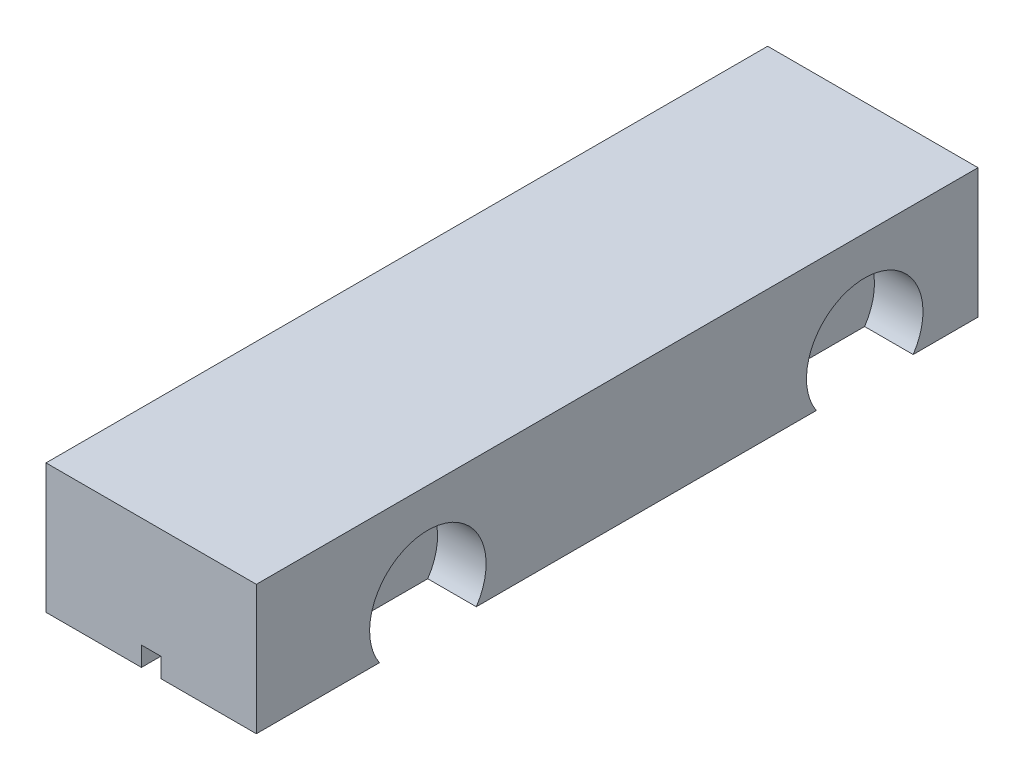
ISO-10303-21;
HEADER;
FILE_DESCRIPTION(('STEP AP214'),'2;1');
FILE_NAME('part.step','',(''),(''),'','','');
FILE_SCHEMA(('AUTOMOTIVE_DESIGN { 1 0 10303 214 1 1 1 1 }'));
ENDSEC;
DATA;
#1=APPLICATION_CONTEXT('core data for automotive mechanical design processes');
#2=APPLICATION_PROTOCOL_DEFINITION('international standard','automotive_design',2000,#1);
#3=PRODUCT_CONTEXT('',#1,'mechanical');
#4=PRODUCT('Part','Part','',(#3));
#5=PRODUCT_RELATED_PRODUCT_CATEGORY('part','',(#4));
#6=PRODUCT_DEFINITION_FORMATION('','',#4);
#7=PRODUCT_DEFINITION_CONTEXT('part definition',#1,'design');
#8=PRODUCT_DEFINITION('design','',#6,#7);
#9=PRODUCT_DEFINITION_SHAPE('','',#8);
#10=(LENGTH_UNIT() NAMED_UNIT(*) SI_UNIT(.MILLI.,.METRE.));
#11=(NAMED_UNIT(*) PLANE_ANGLE_UNIT() SI_UNIT($,.RADIAN.));
#12=(NAMED_UNIT(*) SI_UNIT($,.STERADIAN.) SOLID_ANGLE_UNIT());
#13=UNCERTAINTY_MEASURE_WITH_UNIT(LENGTH_MEASURE(1.E-05),#10,'distance_accuracy_value','');
#14=(GEOMETRIC_REPRESENTATION_CONTEXT(3) GLOBAL_UNCERTAINTY_ASSIGNED_CONTEXT((#13)) GLOBAL_UNIT_ASSIGNED_CONTEXT((#10,
#11,#12)) REPRESENTATION_CONTEXT('',''));
#15=CARTESIAN_POINT('',(0.,0.,0.));
#16=DIRECTION('',(0.,0.,1.));
#17=DIRECTION('',(1.,0.,0.));
#18=AXIS2_PLACEMENT_3D('',#15,#16,#17);
#19=CARTESIAN_POINT('',(-32.5,10.,170.));
#20=DIRECTION('',(1.,0.,0.));
#21=DIRECTION('',(0.,0.,-1.));
#22=AXIS2_PLACEMENT_3D('',#19,#20,#21);
#23=CYLINDRICAL_SURFACE('',#22,1.52500000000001);
#24=CARTESIAN_POINT('',(17.5,10.,170.));
#25=DIRECTION('',(1.,0.,0.));
#26=DIRECTION('',(0.,0.,-1.));
#27=AXIS2_PLACEMENT_3D('',#24,#25,#26);
#28=CIRCLE('',#27,1.52500000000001);
#29=CARTESIAN_POINT('',(17.5,10.,168.475));
#30=VERTEX_POINT('',#29);
#31=EDGE_CURVE('E192',#30,#30,#28,.F.);
#32=ORIENTED_EDGE('',*,*,#31,.F.);
#33=EDGE_LOOP('',(#32));
#34=FACE_BOUND('',#33,.T.);
#35=CARTESIAN_POINT('',(-17.5,10.,170.));
#36=DIRECTION('',(-1.,0.,0.));
#37=DIRECTION('',(0.,0.,1.));
#38=AXIS2_PLACEMENT_3D('',#35,#36,#37);
#39=CIRCLE('',#38,1.52500000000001);
#40=CARTESIAN_POINT('',(-17.5,10.,171.525));
#41=VERTEX_POINT('',#40);
#42=EDGE_CURVE('E149',#41,#41,#39,.F.);
#43=ORIENTED_EDGE('',*,*,#42,.F.);
#44=EDGE_LOOP('',(#43));
#45=FACE_BOUND('',#44,.T.);
#46=ADVANCED_FACE('F32',(#34,#45),#23,.F.);
#47=CARTESIAN_POINT('',(-32.5,10.,35.));
#48=DIRECTION('',(1.,0.,0.));
#49=DIRECTION('',(0.,0.,-1.));
#50=AXIS2_PLACEMENT_3D('',#47,#48,#49);
#51=CYLINDRICAL_SURFACE('',#50,1.525);
#52=CARTESIAN_POINT('',(17.5,10.,35.));
#53=DIRECTION('',(1.,0.,0.));
#54=DIRECTION('',(0.,0.,-1.));
#55=AXIS2_PLACEMENT_3D('',#52,#53,#54);
#56=CIRCLE('',#55,1.525);
#57=CARTESIAN_POINT('',(17.5,10.,33.475));
#58=VERTEX_POINT('',#57);
#59=EDGE_CURVE('E178',#58,#58,#56,.F.);
#60=ORIENTED_EDGE('',*,*,#59,.F.);
#61=EDGE_LOOP('',(#60));
#62=FACE_BOUND('',#61,.T.);
#63=CARTESIAN_POINT('',(-17.5,10.,35.));
#64=DIRECTION('',(-1.,0.,0.));
#65=DIRECTION('',(0.,0.,1.));
#66=AXIS2_PLACEMENT_3D('',#63,#64,#65);
#67=CIRCLE('',#66,1.525);
#68=CARTESIAN_POINT('',(-17.5,10.,36.525));
#69=VERTEX_POINT('',#68);
#70=EDGE_CURVE('E171',#69,#69,#67,.F.);
#71=ORIENTED_EDGE('',*,*,#70,.F.);
#72=EDGE_LOOP('',(#71));
#73=FACE_BOUND('',#72,.T.);
#74=ADVANCED_FACE('F334',(#62,#73),#51,.F.);
#75=CARTESIAN_POINT('',(-32.5,0.,223.));
#76=DIRECTION('',(0.,1.,0.));
#77=DIRECTION('',(0.,0.,1.));
#78=AXIS2_PLACEMENT_3D('',#75,#76,#77);
#79=PLANE('',#78);
#80=DIRECTION('',(0.,0.,1.));
#81=VECTOR('',#80,1.);
#82=CARTESIAN_POINT('',(-17.5,0.,223.));
#83=LINE('',#82,#81);
#84=CARTESIAN_POINT('',(-17.5,0.,155.033370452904));
#85=VERTEX_POINT('',#84);
#86=CARTESIAN_POINT('',(-17.5,0.,184.966629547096));
#87=VERTEX_POINT('',#86);
#88=EDGE_CURVE('E11',#85,#87,#83,.T.);
#89=ORIENTED_EDGE('',*,*,#88,.F.);
#90=DIRECTION('',(-1.,0.,0.));
#91=VECTOR('',#90,1.);
#92=CARTESIAN_POINT('',(-17.5,0.,155.033370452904));
#93=LINE('',#92,#91);
#94=CARTESIAN_POINT('',(-32.5,0.,155.033370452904));
#95=VERTEX_POINT('',#94);
#96=EDGE_CURVE('E144',#85,#95,#93,.T.);
#97=ORIENTED_EDGE('',*,*,#96,.T.);
#98=DIRECTION('',(0.,0.,-1.));
#99=VECTOR('',#98,1.);
#100=CARTESIAN_POINT('',(-32.5,0.,223.));
#101=LINE('',#100,#99);
#102=CARTESIAN_POINT('',(-32.5,0.,49.9666295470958));
#103=VERTEX_POINT('',#102);
#104=EDGE_CURVE('E55',#95,#103,#101,.T.);
#105=ORIENTED_EDGE('',*,*,#104,.T.);
#106=DIRECTION('',(-1.,0.,0.));
#107=VECTOR('',#106,1.);
#108=CARTESIAN_POINT('',(-17.5,0.,49.9666295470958));
#109=LINE('',#108,#107);
#110=CARTESIAN_POINT('',(-17.5,0.,49.9666295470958));
#111=VERTEX_POINT('',#110);
#112=EDGE_CURVE('E166',#103,#111,#109,.F.);
#113=ORIENTED_EDGE('',*,*,#112,.T.);
#114=DIRECTION('',(0.,0.,1.));
#115=VECTOR('',#114,1.);
#116=CARTESIAN_POINT('',(-17.5,0.,223.));
#117=LINE('',#116,#115);
#118=CARTESIAN_POINT('',(-17.5,0.,20.0333704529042));
#119=VERTEX_POINT('',#118);
#120=EDGE_CURVE('E270',#119,#111,#117,.T.);
#121=ORIENTED_EDGE('',*,*,#120,.F.);
#122=DIRECTION('',(-1.,0.,0.));
#123=VECTOR('',#122,1.);
#124=CARTESIAN_POINT('',(-17.5,0.,20.0333704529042));
#125=LINE('',#124,#123);
#126=CARTESIAN_POINT('',(-32.5,0.,20.0333704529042));
#127=VERTEX_POINT('',#126);
#128=EDGE_CURVE('E168',#119,#127,#125,.T.);
#129=ORIENTED_EDGE('',*,*,#128,.T.);
#130=CARTESIAN_POINT('',(-32.5,0.,0.));
#131=VERTEX_POINT('',#130);
#132=EDGE_CURVE('E260',#127,#131,#101,.T.);
#133=ORIENTED_EDGE('',*,*,#132,.T.);
#134=DIRECTION('',(1.,0.,0.));
#135=VECTOR('',#134,1.);
#136=CARTESIAN_POINT('',(-32.5,0.,0.));
#137=LINE('',#136,#135);
#138=CARTESIAN_POINT('',(-3.,0.,0.));
#139=VERTEX_POINT('',#138);
#140=EDGE_CURVE('E245',#131,#139,#137,.T.);
#141=ORIENTED_EDGE('',*,*,#140,.T.);
#142=DIRECTION('',(0.,0.,1.));
#143=VECTOR('',#142,1.);
#144=CARTESIAN_POINT('',(-3.,0.,0.));
#145=LINE('',#144,#143);
#146=CARTESIAN_POINT('',(-3.,0.,223.));
#147=VERTEX_POINT('',#146);
#148=EDGE_CURVE('E213',#139,#147,#145,.T.);
#149=ORIENTED_EDGE('',*,*,#148,.T.);
#150=DIRECTION('',(1.,0.,0.));
#151=VECTOR('',#150,1.);
#152=CARTESIAN_POINT('',(-32.5,0.,223.));
#153=LINE('',#152,#151);
#154=CARTESIAN_POINT('',(-32.5,0.,223.));
#155=VERTEX_POINT('',#154);
#156=EDGE_CURVE('E234',#155,#147,#153,.T.);
#157=ORIENTED_EDGE('',*,*,#156,.F.);
#158=CARTESIAN_POINT('',(-32.5,0.,184.966629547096));
#159=VERTEX_POINT('',#158);
#160=EDGE_CURVE('E158',#155,#159,#101,.T.);
#161=ORIENTED_EDGE('',*,*,#160,.T.);
#162=DIRECTION('',(-1.,0.,0.));
#163=VECTOR('',#162,1.);
#164=CARTESIAN_POINT('',(-17.5,0.,184.966629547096));
#165=LINE('',#164,#163);
#166=EDGE_CURVE('E47',#159,#87,#165,.F.);
#167=ORIENTED_EDGE('',*,*,#166,.T.);
#168=EDGE_LOOP('',(#89,#97,#105,#113,#121,#129,#133,#141,#149,#157,#161,#167));
#169=FACE_BOUND('',#168,.T.);
#170=ADVANCED_FACE('F155',(#169),#79,.F.);
#171=CARTESIAN_POINT('',(-32.5,0.,223.));
#172=DIRECTION('',(1.,0.,0.));
#173=DIRECTION('',(0.,0.,-1.));
#174=AXIS2_PLACEMENT_3D('',#171,#172,#173);
#175=PLANE('',#174);
#176=ORIENTED_EDGE('',*,*,#104,.F.);
#177=CARTESIAN_POINT('',(-32.5,10.,170.));
#178=DIRECTION('',(1.,0.,0.));
#179=DIRECTION('',(0.,0.,-1.));
#180=AXIS2_PLACEMENT_3D('',#177,#178,#179);
#181=CIRCLE('',#180,18.);
#182=EDGE_CURVE('E40',#95,#159,#181,.T.);
#183=ORIENTED_EDGE('',*,*,#182,.T.);
#184=ORIENTED_EDGE('',*,*,#160,.F.);
#185=DIRECTION('',(0.,-1.,0.));
#186=VECTOR('',#185,1.);
#187=CARTESIAN_POINT('',(-32.5,0.,223.));
#188=LINE('',#187,#186);
#189=CARTESIAN_POINT('',(-32.5,40.,223.));
#190=VERTEX_POINT('',#189);
#191=EDGE_CURVE('E229',#190,#155,#188,.T.);
#192=ORIENTED_EDGE('',*,*,#191,.F.);
#193=DIRECTION('',(0.,0.,-1.));
#194=VECTOR('',#193,1.);
#195=CARTESIAN_POINT('',(-32.5,40.,223.));
#196=LINE('',#195,#194);
#197=CARTESIAN_POINT('',(-32.5,40.,0.));
#198=VERTEX_POINT('',#197);
#199=EDGE_CURVE('E241',#190,#198,#196,.T.);
#200=ORIENTED_EDGE('',*,*,#199,.T.);
#201=DIRECTION('',(0.,-1.,0.));
#202=VECTOR('',#201,1.);
#203=CARTESIAN_POINT('',(-32.5,0.,0.));
#204=LINE('',#203,#202);
#205=EDGE_CURVE('E222',#198,#131,#204,.T.);
#206=ORIENTED_EDGE('',*,*,#205,.T.);
#207=ORIENTED_EDGE('',*,*,#132,.F.);
#208=CARTESIAN_POINT('',(-32.5,10.,35.));
#209=DIRECTION('',(1.,0.,0.));
#210=DIRECTION('',(0.,0.,-1.));
#211=AXIS2_PLACEMENT_3D('',#208,#209,#210);
#212=CIRCLE('',#211,18.);
#213=EDGE_CURVE('E263',#127,#103,#212,.T.);
#214=ORIENTED_EDGE('',*,*,#213,.T.);
#215=EDGE_LOOP('',(#176,#183,#184,#192,#200,#206,#207,#214));
#216=FACE_BOUND('',#215,.T.);
#217=ADVANCED_FACE('F34',(#216),#175,.F.);
#218=DIRECTION('',(0.,0.,-1.));
#219=VECTOR('',#218,1.);
#220=CARTESIAN_POINT('',(17.5,0.,223.));
#221=LINE('',#220,#219);
#222=CARTESIAN_POINT('',(17.5,0.,49.9666295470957));
#223=VERTEX_POINT('',#222);
#224=CARTESIAN_POINT('',(17.5,0.,20.0333704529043));
#225=VERTEX_POINT('',#224);
#226=EDGE_CURVE('E180',#223,#225,#221,.T.);
#227=ORIENTED_EDGE('',*,*,#226,.F.);
#228=DIRECTION('',(1.,0.,0.));
#229=VECTOR('',#228,1.);
#230=CARTESIAN_POINT('',(17.5,0.,49.9666295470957));
#231=LINE('',#230,#229);
#232=CARTESIAN_POINT('',(32.5,0.,49.9666295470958));
#233=VERTEX_POINT('',#232);
#234=EDGE_CURVE('E185',#223,#233,#231,.T.);
#235=ORIENTED_EDGE('',*,*,#234,.T.);
#236=DIRECTION('',(0.,0.,-1.));
#237=VECTOR('',#236,1.);
#238=CARTESIAN_POINT('',(32.5,0.,223.));
#239=LINE('',#238,#237);
#240=CARTESIAN_POINT('',(32.5,0.,155.033370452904));
#241=VERTEX_POINT('',#240);
#242=EDGE_CURVE('E261',#241,#233,#239,.T.);
#243=ORIENTED_EDGE('',*,*,#242,.F.);
#244=DIRECTION('',(1.,0.,0.));
#245=VECTOR('',#244,1.);
#246=CARTESIAN_POINT('',(17.5,0.,155.033370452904));
#247=LINE('',#246,#245);
#248=CARTESIAN_POINT('',(17.5,0.,155.033370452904));
#249=VERTEX_POINT('',#248);
#250=EDGE_CURVE('E196',#241,#249,#247,.F.);
#251=ORIENTED_EDGE('',*,*,#250,.T.);
#252=DIRECTION('',(0.,0.,-1.));
#253=VECTOR('',#252,1.);
#254=CARTESIAN_POINT('',(17.5,0.,223.));
#255=LINE('',#254,#253);
#256=CARTESIAN_POINT('',(17.5,0.,184.966629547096));
#257=VERTEX_POINT('',#256);
#258=EDGE_CURVE('E194',#257,#249,#255,.T.);
#259=ORIENTED_EDGE('',*,*,#258,.F.);
#260=DIRECTION('',(1.,0.,0.));
#261=VECTOR('',#260,1.);
#262=CARTESIAN_POINT('',(17.5,0.,184.966629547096));
#263=LINE('',#262,#261);
#264=CARTESIAN_POINT('',(32.5,0.,184.966629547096));
#265=VERTEX_POINT('',#264);
#266=EDGE_CURVE('E199',#257,#265,#263,.T.);
#267=ORIENTED_EDGE('',*,*,#266,.T.);
#268=CARTESIAN_POINT('',(32.5,0.,223.));
#269=VERTEX_POINT('',#268);
#270=EDGE_CURVE('E257',#269,#265,#239,.T.);
#271=ORIENTED_EDGE('',*,*,#270,.F.);
#272=CARTESIAN_POINT('',(3.,0.,223.));
#273=VERTEX_POINT('',#272);
#274=EDGE_CURVE('E232',#273,#269,#153,.T.);
#275=ORIENTED_EDGE('',*,*,#274,.F.);
#276=DIRECTION('',(0.,0.,1.));
#277=VECTOR('',#276,1.);
#278=CARTESIAN_POINT('',(3.,0.,0.));
#279=LINE('',#278,#277);
#280=CARTESIAN_POINT('',(3.,0.,0.));
#281=VERTEX_POINT('',#280);
#282=EDGE_CURVE('E225',#281,#273,#279,.T.);
#283=ORIENTED_EDGE('',*,*,#282,.F.);
#284=CARTESIAN_POINT('',(32.5,0.,0.));
#285=VERTEX_POINT('',#284);
#286=EDGE_CURVE('E244',#281,#285,#137,.T.);
#287=ORIENTED_EDGE('',*,*,#286,.T.);
#288=CARTESIAN_POINT('',(32.5,0.,20.0333704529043));
#289=VERTEX_POINT('',#288);
#290=EDGE_CURVE('E256',#289,#285,#239,.T.);
#291=ORIENTED_EDGE('',*,*,#290,.F.);
#292=DIRECTION('',(1.,0.,0.));
#293=VECTOR('',#292,1.);
#294=CARTESIAN_POINT('',(17.5,0.,20.0333704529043));
#295=LINE('',#294,#293);
#296=EDGE_CURVE('E182',#289,#225,#295,.F.);
#297=ORIENTED_EDGE('',*,*,#296,.T.);
#298=EDGE_LOOP('',(#227,#235,#243,#251,#259,#267,#271,#275,#283,#287,#291,#297));
#299=FACE_BOUND('',#298,.T.);
#300=ADVANCED_FACE('F298',(#299),#79,.F.);
#301=CARTESIAN_POINT('',(32.5,0.,223.));
#302=DIRECTION('',(-1.,0.,0.));
#303=DIRECTION('',(0.,0.,1.));
#304=AXIS2_PLACEMENT_3D('',#301,#302,#303);
#305=PLANE('',#304);
#306=ORIENTED_EDGE('',*,*,#242,.T.);
#307=CARTESIAN_POINT('',(32.5,10.,35.));
#308=DIRECTION('',(1.,0.,0.));
#309=DIRECTION('',(0.,0.,-1.));
#310=AXIS2_PLACEMENT_3D('',#307,#308,#309);
#311=CIRCLE('',#310,18.);
#312=EDGE_CURVE('E174',#289,#233,#311,.T.);
#313=ORIENTED_EDGE('',*,*,#312,.F.);
#314=ORIENTED_EDGE('',*,*,#290,.T.);
#315=DIRECTION('',(0.,1.,0.));
#316=VECTOR('',#315,1.);
#317=CARTESIAN_POINT('',(32.5,0.,0.));
#318=LINE('',#317,#316);
#319=CARTESIAN_POINT('',(32.5,40.,0.));
#320=VERTEX_POINT('',#319);
#321=EDGE_CURVE('E248',#285,#320,#318,.T.);
#322=ORIENTED_EDGE('',*,*,#321,.T.);
#323=DIRECTION('',(0.,0.,-1.));
#324=VECTOR('',#323,1.);
#325=CARTESIAN_POINT('',(32.5,40.,223.));
#326=LINE('',#325,#324);
#327=CARTESIAN_POINT('',(32.5,40.,223.));
#328=VERTEX_POINT('',#327);
#329=EDGE_CURVE('E253',#328,#320,#326,.T.);
#330=ORIENTED_EDGE('',*,*,#329,.F.);
#331=DIRECTION('',(0.,1.,0.));
#332=VECTOR('',#331,1.);
#333=CARTESIAN_POINT('',(32.5,0.,223.));
#334=LINE('',#333,#332);
#335=EDGE_CURVE('E237',#269,#328,#334,.T.);
#336=ORIENTED_EDGE('',*,*,#335,.F.);
#337=ORIENTED_EDGE('',*,*,#270,.T.);
#338=CARTESIAN_POINT('',(32.5,10.,170.));
#339=DIRECTION('',(1.,0.,0.));
#340=DIRECTION('',(0.,0.,-1.));
#341=AXIS2_PLACEMENT_3D('',#338,#339,#340);
#342=CIRCLE('',#341,18.);
#343=EDGE_CURVE('E188',#241,#265,#342,.T.);
#344=ORIENTED_EDGE('',*,*,#343,.F.);
#345=EDGE_LOOP('',(#306,#313,#314,#322,#330,#336,#337,#344));
#346=FACE_BOUND('',#345,.T.);
#347=ADVANCED_FACE('F291',(#346),#305,.F.);
#348=CARTESIAN_POINT('',(-32.5,40.,223.));
#349=DIRECTION('',(0.,-1.,0.));
#350=DIRECTION('',(0.,0.,-1.));
#351=AXIS2_PLACEMENT_3D('',#348,#349,#350);
#352=PLANE('',#351);
#353=DIRECTION('',(-1.,0.,0.));
#354=VECTOR('',#353,1.);
#355=CARTESIAN_POINT('',(-32.5,40.,0.));
#356=LINE('',#355,#354);
#357=EDGE_CURVE('E233',#320,#198,#356,.T.);
#358=ORIENTED_EDGE('',*,*,#357,.T.);
#359=ORIENTED_EDGE('',*,*,#199,.F.);
#360=DIRECTION('',(-1.,0.,0.));
#361=VECTOR('',#360,1.);
#362=CARTESIAN_POINT('',(-32.5,40.,223.));
#363=LINE('',#362,#361);
#364=EDGE_CURVE('E239',#328,#190,#363,.T.);
#365=ORIENTED_EDGE('',*,*,#364,.F.);
#366=ORIENTED_EDGE('',*,*,#329,.T.);
#367=EDGE_LOOP('',(#358,#359,#365,#366));
#368=FACE_BOUND('',#367,.T.);
#369=ADVANCED_FACE('F284',(#368),#352,.F.);
#370=CARTESIAN_POINT('',(-32.5,40.,223.));
#371=DIRECTION('',(0.,0.,-1.));
#372=DIRECTION('',(-1.,0.,0.));
#373=AXIS2_PLACEMENT_3D('',#370,#371,#372);
#374=PLANE('',#373);
#375=ORIENTED_EDGE('',*,*,#156,.T.);
#376=DIRECTION('',(0.,-1.,0.));
#377=VECTOR('',#376,1.);
#378=CARTESIAN_POINT('',(-3.,0.,223.));
#379=LINE('',#378,#377);
#380=CARTESIAN_POINT('',(-3.,6.,223.));
#381=VERTEX_POINT('',#380);
#382=EDGE_CURVE('E202',#381,#147,#379,.T.);
#383=ORIENTED_EDGE('',*,*,#382,.F.);
#384=DIRECTION('',(-1.,0.,0.));
#385=VECTOR('',#384,1.);
#386=CARTESIAN_POINT('',(-3.,6.,223.));
#387=LINE('',#386,#385);
#388=CARTESIAN_POINT('',(3.,6.,223.));
#389=VERTEX_POINT('',#388);
#390=EDGE_CURVE('E207',#389,#381,#387,.T.);
#391=ORIENTED_EDGE('',*,*,#390,.F.);
#392=DIRECTION('',(0.,1.,0.));
#393=VECTOR('',#392,1.);
#394=CARTESIAN_POINT('',(3.,0.,223.));
#395=LINE('',#394,#393);
#396=EDGE_CURVE('E215',#273,#389,#395,.T.);
#397=ORIENTED_EDGE('',*,*,#396,.F.);
#398=ORIENTED_EDGE('',*,*,#274,.T.);
#399=ORIENTED_EDGE('',*,*,#335,.T.);
#400=ORIENTED_EDGE('',*,*,#364,.T.);
#401=ORIENTED_EDGE('',*,*,#191,.T.);
#402=EDGE_LOOP('',(#375,#383,#391,#397,#398,#399,#400,#401));
#403=FACE_BOUND('',#402,.T.);
#404=ADVANCED_FACE('F307',(#403),#374,.F.);
#405=CARTESIAN_POINT('',(-32.5,40.,0.));
#406=DIRECTION('',(0.,0.,-1.));
#407=DIRECTION('',(-1.,0.,0.));
#408=AXIS2_PLACEMENT_3D('',#405,#406,#407);
#409=PLANE('',#408);
#410=DIRECTION('',(0.,-1.,0.));
#411=VECTOR('',#410,1.);
#412=CARTESIAN_POINT('',(-3.,0.,0.));
#413=LINE('',#412,#411);
#414=CARTESIAN_POINT('',(-3.,6.,0.));
#415=VERTEX_POINT('',#414);
#416=EDGE_CURVE('E203',#415,#139,#413,.T.);
#417=ORIENTED_EDGE('',*,*,#416,.T.);
#418=ORIENTED_EDGE('',*,*,#140,.F.);
#419=ORIENTED_EDGE('',*,*,#205,.F.);
#420=ORIENTED_EDGE('',*,*,#357,.F.);
#421=ORIENTED_EDGE('',*,*,#321,.F.);
#422=ORIENTED_EDGE('',*,*,#286,.F.);
#423=DIRECTION('',(0.,1.,0.));
#424=VECTOR('',#423,1.);
#425=CARTESIAN_POINT('',(3.,0.,0.));
#426=LINE('',#425,#424);
#427=CARTESIAN_POINT('',(3.00000000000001,6.,0.));
#428=VERTEX_POINT('',#427);
#429=EDGE_CURVE('E206',#281,#428,#426,.T.);
#430=ORIENTED_EDGE('',*,*,#429,.T.);
#431=DIRECTION('',(-1.,0.,0.));
#432=VECTOR('',#431,1.);
#433=CARTESIAN_POINT('',(-3.,6.,0.));
#434=LINE('',#433,#432);
#435=EDGE_CURVE('E210',#428,#415,#434,.T.);
#436=ORIENTED_EDGE('',*,*,#435,.T.);
#437=EDGE_LOOP('',(#417,#418,#419,#420,#421,#422,#430,#436));
#438=FACE_BOUND('',#437,.T.);
#439=ADVANCED_FACE('F278',(#438),#409,.T.);
#440=CARTESIAN_POINT('',(-3.,0.,0.));
#441=DIRECTION('',(-1.,0.,0.));
#442=DIRECTION('',(0.,0.,1.));
#443=AXIS2_PLACEMENT_3D('',#440,#441,#442);
#444=PLANE('',#443);
#445=ORIENTED_EDGE('',*,*,#382,.T.);
#446=ORIENTED_EDGE('',*,*,#148,.F.);
#447=ORIENTED_EDGE('',*,*,#416,.F.);
#448=DIRECTION('',(0.,0.,1.));
#449=VECTOR('',#448,1.);
#450=CARTESIAN_POINT('',(-3.,6.,0.));
#451=LINE('',#450,#449);
#452=EDGE_CURVE('E220',#415,#381,#451,.T.);
#453=ORIENTED_EDGE('',*,*,#452,.T.);
#454=EDGE_LOOP('',(#445,#446,#447,#453));
#455=FACE_BOUND('',#454,.T.);
#456=ADVANCED_FACE('F312',(#455),#444,.F.);
#457=CARTESIAN_POINT('',(-3.,6.,0.));
#458=DIRECTION('',(0.,1.,0.));
#459=DIRECTION('',(0.,0.,1.));
#460=AXIS2_PLACEMENT_3D('',#457,#458,#459);
#461=PLANE('',#460);
#462=ORIENTED_EDGE('',*,*,#390,.T.);
#463=ORIENTED_EDGE('',*,*,#452,.F.);
#464=ORIENTED_EDGE('',*,*,#435,.F.);
#465=DIRECTION('',(0.,0.,1.));
#466=VECTOR('',#465,1.);
#467=CARTESIAN_POINT('',(3.,6.,0.));
#468=LINE('',#467,#466);
#469=EDGE_CURVE('E223',#428,#389,#468,.T.);
#470=ORIENTED_EDGE('',*,*,#469,.T.);
#471=EDGE_LOOP('',(#462,#463,#464,#470));
#472=FACE_BOUND('',#471,.T.);
#473=ADVANCED_FACE('F310',(#472),#461,.F.);
#474=CARTESIAN_POINT('',(3.,0.,0.));
#475=DIRECTION('',(1.,0.,0.));
#476=DIRECTION('',(0.,1.,0.));
#477=AXIS2_PLACEMENT_3D('',#474,#475,#476);
#478=PLANE('',#477);
#479=ORIENTED_EDGE('',*,*,#396,.T.);
#480=ORIENTED_EDGE('',*,*,#469,.F.);
#481=ORIENTED_EDGE('',*,*,#429,.F.);
#482=ORIENTED_EDGE('',*,*,#282,.T.);
#483=EDGE_LOOP('',(#479,#480,#481,#482));
#484=FACE_BOUND('',#483,.T.);
#485=ADVANCED_FACE('F303',(#484),#478,.F.);
#486=CARTESIAN_POINT('',(17.5,10.,170.));
#487=DIRECTION('',(1.,0.,0.));
#488=DIRECTION('',(0.,0.,-1.));
#489=AXIS2_PLACEMENT_3D('',#486,#487,#488);
#490=CYLINDRICAL_SURFACE('',#489,18.);
#491=CARTESIAN_POINT('',(17.5,10.,170.));
#492=DIRECTION('',(1.,0.,0.));
#493=DIRECTION('',(0.,0.,-1.));
#494=AXIS2_PLACEMENT_3D('',#491,#492,#493);
#495=CIRCLE('',#494,18.);
#496=EDGE_CURVE('E189',#249,#257,#495,.T.);
#497=ORIENTED_EDGE('',*,*,#496,.F.);
#498=ORIENTED_EDGE('',*,*,#250,.F.);
#499=ORIENTED_EDGE('',*,*,#343,.T.);
#500=ORIENTED_EDGE('',*,*,#266,.F.);
#501=EDGE_LOOP('',(#497,#498,#499,#500));
#502=FACE_BOUND('',#501,.T.);
#503=ADVANCED_FACE('F318',(#502),#490,.F.);
#504=CARTESIAN_POINT('',(17.5,10.,170.));
#505=DIRECTION('',(1.,0.,0.));
#506=DIRECTION('',(0.,0.,-1.));
#507=AXIS2_PLACEMENT_3D('',#504,#505,#506);
#508=PLANE('',#507);
#509=ORIENTED_EDGE('',*,*,#31,.T.);
#510=EDGE_LOOP('',(#509));
#511=FACE_BOUND('',#510,.T.);
#512=ORIENTED_EDGE('',*,*,#258,.T.);
#513=ORIENTED_EDGE('',*,*,#496,.T.);
#514=EDGE_LOOP('',(#512,#513));
#515=FACE_BOUND('',#514,.T.);
#516=ADVANCED_FACE('F320',(#511,#515),#508,.T.);
#517=CARTESIAN_POINT('',(17.5,10.,35.));
#518=DIRECTION('',(1.,0.,0.));
#519=DIRECTION('',(0.,0.,-1.));
#520=AXIS2_PLACEMENT_3D('',#517,#518,#519);
#521=CYLINDRICAL_SURFACE('',#520,18.);
#522=CARTESIAN_POINT('',(17.5,10.,35.));
#523=DIRECTION('',(1.,0.,0.));
#524=DIRECTION('',(0.,0.,-1.));
#525=AXIS2_PLACEMENT_3D('',#522,#523,#524);
#526=CIRCLE('',#525,18.);
#527=EDGE_CURVE('E175',#225,#223,#526,.T.);
#528=ORIENTED_EDGE('',*,*,#527,.F.);
#529=ORIENTED_EDGE('',*,*,#296,.F.);
#530=ORIENTED_EDGE('',*,*,#312,.T.);
#531=ORIENTED_EDGE('',*,*,#234,.F.);
#532=EDGE_LOOP('',(#528,#529,#530,#531));
#533=FACE_BOUND('',#532,.T.);
#534=ADVANCED_FACE('F322',(#533),#521,.F.);
#535=CARTESIAN_POINT('',(17.5,10.,35.));
#536=DIRECTION('',(1.,0.,0.));
#537=DIRECTION('',(0.,0.,-1.));
#538=AXIS2_PLACEMENT_3D('',#535,#536,#537);
#539=PLANE('',#538);
#540=ORIENTED_EDGE('',*,*,#59,.T.);
#541=EDGE_LOOP('',(#540));
#542=FACE_BOUND('',#541,.T.);
#543=ORIENTED_EDGE('',*,*,#226,.T.);
#544=ORIENTED_EDGE('',*,*,#527,.T.);
#545=EDGE_LOOP('',(#543,#544));
#546=FACE_BOUND('',#545,.T.);
#547=ADVANCED_FACE('F329',(#542,#546),#539,.T.);
#548=CARTESIAN_POINT('',(-17.5,10.,35.));
#549=DIRECTION('',(-1.,0.,0.));
#550=DIRECTION('',(0.,0.,1.));
#551=AXIS2_PLACEMENT_3D('',#548,#549,#550);
#552=PLANE('',#551);
#553=ORIENTED_EDGE('',*,*,#120,.T.);
#554=CARTESIAN_POINT('',(-17.5,10.,35.));
#555=DIRECTION('',(-1.,0.,0.));
#556=DIRECTION('',(0.,0.,1.));
#557=AXIS2_PLACEMENT_3D('',#554,#555,#556);
#558=CIRCLE('',#557,18.);
#559=EDGE_CURVE('E163',#111,#119,#558,.T.);
#560=ORIENTED_EDGE('',*,*,#559,.T.);
#561=EDGE_LOOP('',(#553,#560));
#562=FACE_BOUND('',#561,.T.);
#563=ORIENTED_EDGE('',*,*,#70,.T.);
#564=EDGE_LOOP('',(#563));
#565=FACE_BOUND('',#564,.T.);
#566=ADVANCED_FACE('F377',(#562,#565),#552,.T.);
#567=CARTESIAN_POINT('',(-17.5,10.,35.));
#568=DIRECTION('',(-1.,0.,0.));
#569=DIRECTION('',(0.,0.,1.));
#570=AXIS2_PLACEMENT_3D('',#567,#568,#569);
#571=CYLINDRICAL_SURFACE('',#570,18.);
#572=ORIENTED_EDGE('',*,*,#559,.F.);
#573=ORIENTED_EDGE('',*,*,#112,.F.);
#574=ORIENTED_EDGE('',*,*,#213,.F.);
#575=ORIENTED_EDGE('',*,*,#128,.F.);
#576=EDGE_LOOP('',(#572,#573,#574,#575));
#577=FACE_BOUND('',#576,.T.);
#578=ADVANCED_FACE('F382',(#577),#571,.F.);
#579=CARTESIAN_POINT('',(-17.5,10.,170.));
#580=DIRECTION('',(-1.,0.,0.));
#581=DIRECTION('',(0.,0.,1.));
#582=AXIS2_PLACEMENT_3D('',#579,#580,#581);
#583=PLANE('',#582);
#584=ORIENTED_EDGE('',*,*,#88,.T.);
#585=CARTESIAN_POINT('',(-17.5,10.,170.));
#586=DIRECTION('',(-1.,0.,0.));
#587=DIRECTION('',(0.,0.,1.));
#588=AXIS2_PLACEMENT_3D('',#585,#586,#587);
#589=CIRCLE('',#588,18.);
#590=EDGE_CURVE('E147',#87,#85,#589,.T.);
#591=ORIENTED_EDGE('',*,*,#590,.T.);
#592=EDGE_LOOP('',(#584,#591));
#593=FACE_BOUND('',#592,.T.);
#594=ORIENTED_EDGE('',*,*,#42,.T.);
#595=EDGE_LOOP('',(#594));
#596=FACE_BOUND('',#595,.T.);
#597=ADVANCED_FACE('F152',(#593,#596),#583,.T.);
#598=CARTESIAN_POINT('',(-17.5,10.,170.));
#599=DIRECTION('',(-1.,0.,0.));
#600=DIRECTION('',(0.,0.,1.));
#601=AXIS2_PLACEMENT_3D('',#598,#599,#600);
#602=CYLINDRICAL_SURFACE('',#601,18.);
#603=ORIENTED_EDGE('',*,*,#590,.F.);
#604=ORIENTED_EDGE('',*,*,#166,.F.);
#605=ORIENTED_EDGE('',*,*,#182,.F.);
#606=ORIENTED_EDGE('',*,*,#96,.F.);
#607=EDGE_LOOP('',(#603,#604,#605,#606));
#608=FACE_BOUND('',#607,.T.);
#609=ADVANCED_FACE('F146',(#608),#602,.F.);
#610=CLOSED_SHELL('',(#46,#74,#170,#217,#300,#347,#369,#404,#439,#456,#473,#485,#503,#516,#534,
#547,#566,#578,#597,#609));
#611=MANIFOLD_SOLID_BREP('B2',#610);
#612=ADVANCED_BREP_SHAPE_REPRESENTATION('',(#18,#611),#14);
#613=SHAPE_DEFINITION_REPRESENTATION(#9,#612);
ENDSEC;
END-ISO-10303-21;
